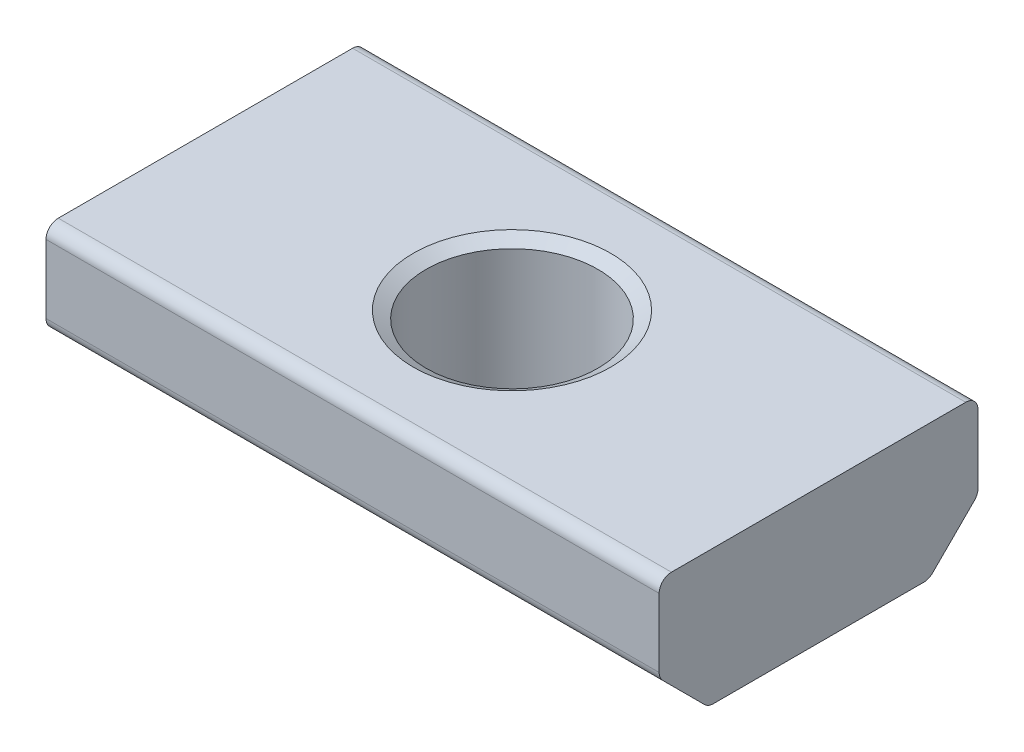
from build123d import *

# Parameters (mm, degrees)
SKETCH1_W                       = 25
SKETCH1_H                       = 13
BOSS_EXTRUDE1_DEPTH             = 5.5
CHAMFER1_SIZE                   = 2
FILLET1_R                       = 0.5
M8X1_0_TAPPED_HOLE1_D           = 7
M8X1_0_TAPPED_HOLE1_CSINK_D     = 8.05
M8X1_0_TAPPED_HOLE1_CSINK_ANGLE = 120


with BuildPart() as part:
    # Sketch1 → Boss-Extrude1 (new body)
    with BuildSketch(Plane(origin=(0, 0, 0), x_dir=(1, 0, 0), z_dir=(0, 1, 0))):
        with Locations((12.5, 6.5)):
            Rectangle(SKETCH1_W, SKETCH1_H)
    extrude(amount=BOSS_EXTRUDE1_DEPTH)

    # Chamfer1
    chamfer1_edges = [part.edges().sort_by_distance(p)[0] for p in [
        (12.5, 0, -13),
        (12.5, 0, 0),
    ]]
    chamfer(chamfer1_edges, length=CHAMFER1_SIZE)

    # Fillet1
    fillet1_edges = [part.edges().sort_by_distance(p)[0] for p in [
        (12.5, 2, -13),
        (12.5, 5.5, -13),
        (12.5, 0, -2),
        (12.5, 0, -11),
        (12.5, 2, 0),
        (12.5, 5.5, 0),
    ]]
    fillet(fillet1_edges, radius=FILLET1_R)

    # M8x1.0 Tapped Hole1 (through all)
    with Locations(Plane(origin=(0, 5.5, 0), x_dir=(1, 0, 0), z_dir=(0, 1, 0))):
        with Locations((12.5, 6.5)):
            CounterSinkHole(M8X1_0_TAPPED_HOLE1_D / 2, M8X1_0_TAPPED_HOLE1_CSINK_D / 2, counter_sink_angle=M8X1_0_TAPPED_HOLE1_CSINK_ANGLE)


solid = part.part
